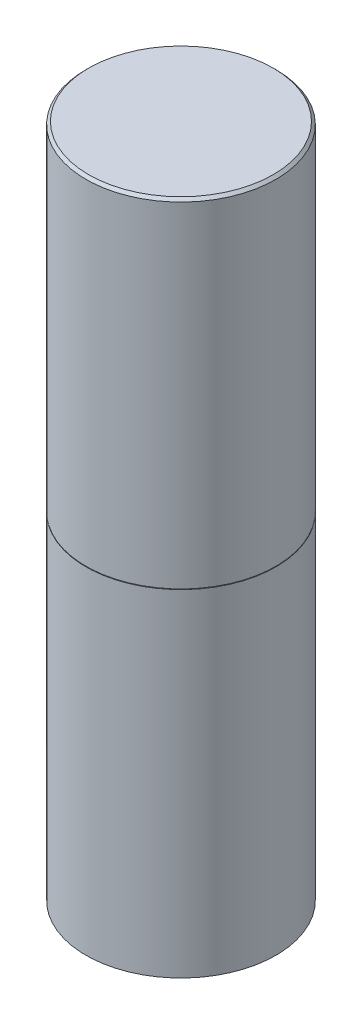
ISO-10303-21;
HEADER;
FILE_DESCRIPTION(('STEP AP214'),'2;1');
FILE_NAME('part.step','',(''),(''),'','','');
FILE_SCHEMA(('AUTOMOTIVE_DESIGN { 1 0 10303 214 1 1 1 1 }'));
ENDSEC;
DATA;
#1=APPLICATION_CONTEXT('core data for automotive mechanical design processes');
#2=APPLICATION_PROTOCOL_DEFINITION('international standard','automotive_design',2000,#1);
#3=PRODUCT_CONTEXT('',#1,'mechanical');
#4=PRODUCT('Part','Part','',(#3));
#5=PRODUCT_RELATED_PRODUCT_CATEGORY('part','',(#4));
#6=PRODUCT_DEFINITION_FORMATION('','',#4);
#7=PRODUCT_DEFINITION_CONTEXT('part definition',#1,'design');
#8=PRODUCT_DEFINITION('design','',#6,#7);
#9=PRODUCT_DEFINITION_SHAPE('','',#8);
#10=(LENGTH_UNIT() NAMED_UNIT(*) SI_UNIT(.MILLI.,.METRE.));
#11=(NAMED_UNIT(*) PLANE_ANGLE_UNIT() SI_UNIT($,.RADIAN.));
#12=(NAMED_UNIT(*) SI_UNIT($,.STERADIAN.) SOLID_ANGLE_UNIT());
#13=UNCERTAINTY_MEASURE_WITH_UNIT(LENGTH_MEASURE(1.E-05),#10,'distance_accuracy_value','');
#14=(GEOMETRIC_REPRESENTATION_CONTEXT(3) GLOBAL_UNCERTAINTY_ASSIGNED_CONTEXT((#13)) GLOBAL_UNIT_ASSIGNED_CONTEXT((#10,
#11,#12)) REPRESENTATION_CONTEXT('',''));
#15=CARTESIAN_POINT('',(0.,0.,0.));
#16=DIRECTION('',(0.,0.,1.));
#17=DIRECTION('',(1.,0.,0.));
#18=AXIS2_PLACEMENT_3D('',#15,#16,#17);
#19=CARTESIAN_POINT('',(0.,0.,17.5));
#20=DIRECTION('',(0.,1.,0.));
#21=DIRECTION('',(0.,0.,1.));
#22=AXIS2_PLACEMENT_3D('',#19,#20,#21);
#23=PLANE('',#22);
#24=CARTESIAN_POINT('',(0.,0.,0.));
#25=DIRECTION('',(0.,-1.,0.));
#26=DIRECTION('',(0.,0.,-1.));
#27=AXIS2_PLACEMENT_3D('',#24,#25,#26);
#28=CIRCLE('',#27,17.5);
#29=CARTESIAN_POINT('',(0.,0.,-17.5));
#30=VERTEX_POINT('',#29);
#31=EDGE_CURVE('E53',#30,#30,#28,.T.);
#32=ORIENTED_EDGE('',*,*,#31,.T.);
#33=EDGE_LOOP('',(#32));
#34=FACE_BOUND('',#33,.T.);
#35=ADVANCED_FACE('F31',(#34),#23,.F.);
#36=CARTESIAN_POINT('',(0.,124.25,0.));
#37=DIRECTION('',(0.,-1.,0.));
#38=DIRECTION('',(0.,0.,-1.));
#39=AXIS2_PLACEMENT_3D('',#36,#37,#38);
#40=PLANE('',#39);
#41=CARTESIAN_POINT('',(0.,124.25,0.));
#42=DIRECTION('',(0.,-1.,0.));
#43=DIRECTION('',(0.,0.,-1.));
#44=AXIS2_PLACEMENT_3D('',#41,#42,#43);
#45=CIRCLE('',#44,17.);
#46=CARTESIAN_POINT('',(0.,124.25,-17.));
#47=VERTEX_POINT('',#46);
#48=EDGE_CURVE('E10',#47,#47,#45,.F.);
#49=ORIENTED_EDGE('',*,*,#48,.T.);
#50=EDGE_LOOP('',(#49));
#51=FACE_BOUND('',#50,.T.);
#52=ADVANCED_FACE('F79',(#51),#40,.F.);
#53=CARTESIAN_POINT('',(0.,0.,0.));
#54=DIRECTION('',(0.,-1.,0.));
#55=DIRECTION('',(0.,0.,-1.));
#56=AXIS2_PLACEMENT_3D('',#53,#54,#55);
#57=CYLINDRICAL_SURFACE('',#56,17.5);
#58=CARTESIAN_POINT('',(0.,123.75,0.));
#59=DIRECTION('',(0.,-1.,0.));
#60=DIRECTION('',(0.,0.,-1.));
#61=AXIS2_PLACEMENT_3D('',#58,#59,#60);
#62=CIRCLE('',#61,17.5);
#63=CARTESIAN_POINT('',(0.,123.75,-17.5));
#64=VERTEX_POINT('',#63);
#65=EDGE_CURVE('E37',#64,#64,#62,.T.);
#66=ORIENTED_EDGE('',*,*,#65,.T.);
#67=EDGE_LOOP('',(#66));
#68=FACE_BOUND('',#67,.T.);
#69=CARTESIAN_POINT('',(0.,62.05,0.));
#70=DIRECTION('',(0.,-1.,0.));
#71=DIRECTION('',(0.,0.,-1.));
#72=AXIS2_PLACEMENT_3D('',#69,#70,#71);
#73=CIRCLE('',#72,17.5);
#74=CARTESIAN_POINT('',(0.,62.05,-17.5));
#75=VERTEX_POINT('',#74);
#76=EDGE_CURVE('E41',#75,#75,#73,.T.);
#77=ORIENTED_EDGE('',*,*,#76,.F.);
#78=EDGE_LOOP('',(#77));
#79=FACE_BOUND('',#78,.T.);
#80=ADVANCED_FACE('F74',(#68,#79),#57,.T.);
#81=CARTESIAN_POINT('',(0.,62.05,0.));
#82=DIRECTION('',(0.,1.,0.));
#83=DIRECTION('',(0.,0.,1.));
#84=AXIS2_PLACEMENT_3D('',#81,#82,#83);
#85=CONICAL_SURFACE('',#84,17.5,1.04719755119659);
#86=CARTESIAN_POINT('',(0.,62.,0.));
#87=DIRECTION('',(0.,-1.,0.));
#88=DIRECTION('',(0.,0.,-1.));
#89=AXIS2_PLACEMENT_3D('',#86,#87,#88);
#90=CIRCLE('',#89,17.4133974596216);
#91=CARTESIAN_POINT('',(0.,62.,-17.4133974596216));
#92=VERTEX_POINT('',#91);
#93=EDGE_CURVE('E45',#92,#92,#90,.T.);
#94=ORIENTED_EDGE('',*,*,#93,.F.);
#95=EDGE_LOOP('',(#94));
#96=FACE_BOUND('',#95,.T.);
#97=ORIENTED_EDGE('',*,*,#76,.T.);
#98=EDGE_LOOP('',(#97));
#99=FACE_BOUND('',#98,.T.);
#100=ADVANCED_FACE('F68',(#96,#99),#85,.T.);
#101=CARTESIAN_POINT('',(0.,62.,0.));
#102=DIRECTION('',(0.,-1.,0.));
#103=DIRECTION('',(0.,0.,-1.));
#104=AXIS2_PLACEMENT_3D('',#101,#102,#103);
#105=CONICAL_SURFACE('',#104,17.4133974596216,1.04719755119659);
#106=CARTESIAN_POINT('',(0.,61.95,0.));
#107=DIRECTION('',(0.,-1.,0.));
#108=DIRECTION('',(0.,0.,-1.));
#109=AXIS2_PLACEMENT_3D('',#106,#107,#108);
#110=CIRCLE('',#109,17.5);
#111=CARTESIAN_POINT('',(0.,61.95,-17.5));
#112=VERTEX_POINT('',#111);
#113=EDGE_CURVE('E50',#112,#112,#110,.T.);
#114=ORIENTED_EDGE('',*,*,#113,.F.);
#115=EDGE_LOOP('',(#114));
#116=FACE_BOUND('',#115,.T.);
#117=ORIENTED_EDGE('',*,*,#93,.T.);
#118=EDGE_LOOP('',(#117));
#119=FACE_BOUND('',#118,.T.);
#120=ADVANCED_FACE('F62',(#116,#119),#105,.T.);
#121=CARTESIAN_POINT('',(0.,0.,0.));
#122=DIRECTION('',(0.,-1.,0.));
#123=DIRECTION('',(0.,0.,-1.));
#124=AXIS2_PLACEMENT_3D('',#121,#122,#123);
#125=CYLINDRICAL_SURFACE('',#124,17.5);
#126=ORIENTED_EDGE('',*,*,#31,.F.);
#127=EDGE_LOOP('',(#126));
#128=FACE_BOUND('',#127,.T.);
#129=ORIENTED_EDGE('',*,*,#113,.T.);
#130=EDGE_LOOP('',(#129));
#131=FACE_BOUND('',#130,.T.);
#132=ADVANCED_FACE('F58',(#128,#131),#125,.T.);
#133=CARTESIAN_POINT('',(0.,123.75,0.));
#134=DIRECTION('',(0.,-1.,0.));
#135=DIRECTION('',(0.,0.,-1.));
#136=AXIS2_PLACEMENT_3D('',#133,#134,#135);
#137=CONICAL_SURFACE('',#136,17.5,0.785398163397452);
#138=ORIENTED_EDGE('',*,*,#48,.F.);
#139=EDGE_LOOP('',(#138));
#140=FACE_BOUND('',#139,.T.);
#141=ORIENTED_EDGE('',*,*,#65,.F.);
#142=EDGE_LOOP('',(#141));
#143=FACE_BOUND('',#142,.T.);
#144=ADVANCED_FACE('F61',(#140,#143),#137,.T.);
#145=CLOSED_SHELL('',(#35,#52,#80,#100,#120,#132,#144));
#146=MANIFOLD_SOLID_BREP('B2',#145);
#147=ADVANCED_BREP_SHAPE_REPRESENTATION('',(#18,#146),#14);
#148=SHAPE_DEFINITION_REPRESENTATION(#9,#147);
ENDSEC;
END-ISO-10303-21;
